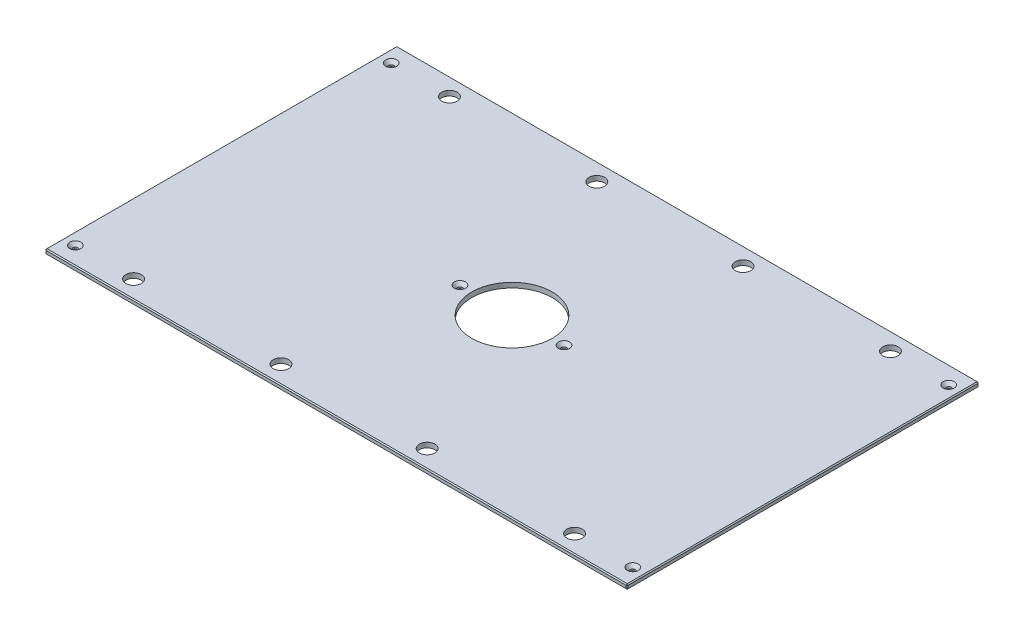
ISO-10303-21;
HEADER;
FILE_DESCRIPTION(('STEP AP214'),'2;1');
FILE_NAME('part.step','',(''),(''),'','','');
FILE_SCHEMA(('AUTOMOTIVE_DESIGN { 1 0 10303 214 1 1 1 1 }'));
ENDSEC;
DATA;
#1=APPLICATION_CONTEXT('core data for automotive mechanical design processes');
#2=APPLICATION_PROTOCOL_DEFINITION('international standard','automotive_design',2000,#1);
#3=PRODUCT_CONTEXT('',#1,'mechanical');
#4=PRODUCT('Part','Part','',(#3));
#5=PRODUCT_RELATED_PRODUCT_CATEGORY('part','',(#4));
#6=PRODUCT_DEFINITION_FORMATION('','',#4);
#7=PRODUCT_DEFINITION_CONTEXT('part definition',#1,'design');
#8=PRODUCT_DEFINITION('design','',#6,#7);
#9=PRODUCT_DEFINITION_SHAPE('','',#8);
#10=(LENGTH_UNIT() NAMED_UNIT(*) SI_UNIT(.MILLI.,.METRE.));
#11=(NAMED_UNIT(*) PLANE_ANGLE_UNIT() SI_UNIT($,.RADIAN.));
#12=(NAMED_UNIT(*) SI_UNIT($,.STERADIAN.) SOLID_ANGLE_UNIT());
#13=UNCERTAINTY_MEASURE_WITH_UNIT(LENGTH_MEASURE(1.E-05),#10,'distance_accuracy_value','');
#14=(GEOMETRIC_REPRESENTATION_CONTEXT(3) GLOBAL_UNCERTAINTY_ASSIGNED_CONTEXT((#13)) GLOBAL_UNIT_ASSIGNED_CONTEXT((#10,
#11,#12)) REPRESENTATION_CONTEXT('',''));
#15=CARTESIAN_POINT('',(0.,0.,0.));
#16=DIRECTION('',(0.,0.,1.));
#17=DIRECTION('',(1.,0.,0.));
#18=AXIS2_PLACEMENT_3D('',#15,#16,#17);
#19=CARTESIAN_POINT('',(-373.0625,6.35,-225.425));
#20=DIRECTION('',(1.,0.,0.));
#21=DIRECTION('',(0.,0.,-1.));
#22=AXIS2_PLACEMENT_3D('',#19,#20,#21);
#23=PLANE('',#22);
#24=DIRECTION('',(0.,0.,-1.));
#25=VECTOR('',#24,1.);
#26=CARTESIAN_POINT('',(-373.0625,5.08000000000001,-225.425));
#27=LINE('',#26,#25);
#28=CARTESIAN_POINT('',(-373.0625,5.08000000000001,224.155));
#29=VERTEX_POINT('',#28);
#30=CARTESIAN_POINT('',(-373.0625,5.08000000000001,-224.155));
#31=VERTEX_POINT('',#30);
#32=EDGE_CURVE('E135',#29,#31,#27,.T.);
#33=ORIENTED_EDGE('',*,*,#32,.T.);
#34=DIRECTION('',(0.,-1.,0.));
#35=VECTOR('',#34,1.);
#36=CARTESIAN_POINT('',(-373.0625,6.35,-224.155));
#37=LINE('',#36,#35);
#38=CARTESIAN_POINT('',(-373.0625,1.26999999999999,-224.155));
#39=VERTEX_POINT('',#38);
#40=EDGE_CURVE('E131',#31,#39,#37,.T.);
#41=ORIENTED_EDGE('',*,*,#40,.T.);
#42=DIRECTION('',(0.,0.,1.));
#43=VECTOR('',#42,1.);
#44=CARTESIAN_POINT('',(-373.0625,1.26999999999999,-225.425));
#45=LINE('',#44,#43);
#46=CARTESIAN_POINT('',(-373.0625,1.26999999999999,224.155));
#47=VERTEX_POINT('',#46);
#48=EDGE_CURVE('E126',#39,#47,#45,.T.);
#49=ORIENTED_EDGE('',*,*,#48,.T.);
#50=DIRECTION('',(0.,1.,0.));
#51=VECTOR('',#50,1.);
#52=CARTESIAN_POINT('',(-373.0625,6.35,224.155));
#53=LINE('',#52,#51);
#54=EDGE_CURVE('E128',#47,#29,#53,.T.);
#55=ORIENTED_EDGE('',*,*,#54,.T.);
#56=EDGE_LOOP('',(#33,#41,#49,#55));
#57=FACE_BOUND('',#56,.T.);
#58=ADVANCED_FACE('F35',(#57),#23,.F.);
#59=CARTESIAN_POINT('',(-373.0625,6.35,225.425));
#60=DIRECTION('',(0.,0.,-1.));
#61=DIRECTION('',(-1.,0.,0.));
#62=AXIS2_PLACEMENT_3D('',#59,#60,#61);
#63=PLANE('',#62);
#64=DIRECTION('',(1.,0.,0.));
#65=VECTOR('',#64,1.);
#66=CARTESIAN_POINT('',(-373.0625,1.26999999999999,225.425));
#67=LINE('',#66,#65);
#68=CARTESIAN_POINT('',(-371.7925,1.26999999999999,225.425));
#69=VERTEX_POINT('',#68);
#70=CARTESIAN_POINT('',(371.7925,1.26999999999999,225.425));
#71=VERTEX_POINT('',#70);
#72=EDGE_CURVE('E58',#69,#71,#67,.T.);
#73=ORIENTED_EDGE('',*,*,#72,.T.);
#74=DIRECTION('',(0.,1.,0.));
#75=VECTOR('',#74,1.);
#76=CARTESIAN_POINT('',(371.7925,6.35,225.425));
#77=LINE('',#76,#75);
#78=CARTESIAN_POINT('',(371.7925,5.08000000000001,225.425));
#79=VERTEX_POINT('',#78);
#80=EDGE_CURVE('E11',#71,#79,#77,.T.);
#81=ORIENTED_EDGE('',*,*,#80,.T.);
#82=DIRECTION('',(-1.,0.,0.));
#83=VECTOR('',#82,1.);
#84=CARTESIAN_POINT('',(-373.0625,5.08000000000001,225.425));
#85=LINE('',#84,#83);
#86=CARTESIAN_POINT('',(-371.7925,5.08000000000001,225.425));
#87=VERTEX_POINT('',#86);
#88=EDGE_CURVE('E44',#79,#87,#85,.T.);
#89=ORIENTED_EDGE('',*,*,#88,.T.);
#90=DIRECTION('',(0.,-1.,0.));
#91=VECTOR('',#90,1.);
#92=CARTESIAN_POINT('',(-371.7925,6.35,225.425));
#93=LINE('',#92,#91);
#94=EDGE_CURVE('E303',#87,#69,#93,.T.);
#95=ORIENTED_EDGE('',*,*,#94,.T.);
#96=EDGE_LOOP('',(#73,#81,#89,#95));
#97=FACE_BOUND('',#96,.T.);
#98=ADVANCED_FACE('F372',(#97),#63,.F.);
#99=CARTESIAN_POINT('',(373.0625,6.35,-225.425));
#100=DIRECTION('',(-1.,0.,0.));
#101=DIRECTION('',(0.,0.,1.));
#102=AXIS2_PLACEMENT_3D('',#99,#100,#101);
#103=PLANE('',#102);
#104=DIRECTION('',(0.,0.,-1.));
#105=VECTOR('',#104,1.);
#106=CARTESIAN_POINT('',(373.0625,1.26999999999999,-225.425));
#107=LINE('',#106,#105);
#108=CARTESIAN_POINT('',(373.0625,1.26999999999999,224.155));
#109=VERTEX_POINT('',#108);
#110=CARTESIAN_POINT('',(373.0625,1.26999999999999,-224.155));
#111=VERTEX_POINT('',#110);
#112=EDGE_CURVE('E298',#109,#111,#107,.T.);
#113=ORIENTED_EDGE('',*,*,#112,.T.);
#114=DIRECTION('',(0.,1.,0.));
#115=VECTOR('',#114,1.);
#116=CARTESIAN_POINT('',(373.0625,6.35,-224.155));
#117=LINE('',#116,#115);
#118=CARTESIAN_POINT('',(373.0625,5.08000000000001,-224.155));
#119=VERTEX_POINT('',#118);
#120=EDGE_CURVE('E300',#111,#119,#117,.T.);
#121=ORIENTED_EDGE('',*,*,#120,.T.);
#122=DIRECTION('',(0.,0.,1.));
#123=VECTOR('',#122,1.);
#124=CARTESIAN_POINT('',(373.0625,5.08000000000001,225.425));
#125=LINE('',#124,#123);
#126=CARTESIAN_POINT('',(373.0625,5.08000000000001,224.155));
#127=VERTEX_POINT('',#126);
#128=EDGE_CURVE('E296',#119,#127,#125,.T.);
#129=ORIENTED_EDGE('',*,*,#128,.T.);
#130=DIRECTION('',(0.,-1.,0.));
#131=VECTOR('',#130,1.);
#132=CARTESIAN_POINT('',(373.0625,6.35,224.155));
#133=LINE('',#132,#131);
#134=EDGE_CURVE('E294',#127,#109,#133,.T.);
#135=ORIENTED_EDGE('',*,*,#134,.T.);
#136=EDGE_LOOP('',(#113,#121,#129,#135));
#137=FACE_BOUND('',#136,.T.);
#138=ADVANCED_FACE('F359',(#137),#103,.F.);
#139=CARTESIAN_POINT('',(-373.0625,6.35,-225.425));
#140=DIRECTION('',(0.,0.,1.));
#141=DIRECTION('',(1.,0.,0.));
#142=AXIS2_PLACEMENT_3D('',#139,#140,#141);
#143=PLANE('',#142);
#144=DIRECTION('',(-1.,0.,0.));
#145=VECTOR('',#144,1.);
#146=CARTESIAN_POINT('',(-373.0625,1.26999999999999,-225.425));
#147=LINE('',#146,#145);
#148=CARTESIAN_POINT('',(371.7925,1.26999999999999,-225.425));
#149=VERTEX_POINT('',#148);
#150=CARTESIAN_POINT('',(-371.7925,1.26999999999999,-225.425));
#151=VERTEX_POINT('',#150);
#152=EDGE_CURVE('E270',#149,#151,#147,.T.);
#153=ORIENTED_EDGE('',*,*,#152,.T.);
#154=DIRECTION('',(0.,1.,0.));
#155=VECTOR('',#154,1.);
#156=CARTESIAN_POINT('',(-371.7925,6.35,-225.425));
#157=LINE('',#156,#155);
#158=CARTESIAN_POINT('',(-371.7925,5.08000000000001,-225.425));
#159=VERTEX_POINT('',#158);
#160=EDGE_CURVE('E274',#151,#159,#157,.T.);
#161=ORIENTED_EDGE('',*,*,#160,.T.);
#162=DIRECTION('',(1.,0.,0.));
#163=VECTOR('',#162,1.);
#164=CARTESIAN_POINT('',(373.0625,5.08000000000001,-225.425));
#165=LINE('',#164,#163);
#166=CARTESIAN_POINT('',(371.7925,5.08000000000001,-225.425));
#167=VERTEX_POINT('',#166);
#168=EDGE_CURVE('E272',#159,#167,#165,.T.);
#169=ORIENTED_EDGE('',*,*,#168,.T.);
#170=DIRECTION('',(0.,-1.,0.));
#171=VECTOR('',#170,1.);
#172=CARTESIAN_POINT('',(371.7925,6.35,-225.425));
#173=LINE('',#172,#171);
#174=EDGE_CURVE('E268',#167,#149,#173,.T.);
#175=ORIENTED_EDGE('',*,*,#174,.T.);
#176=EDGE_LOOP('',(#153,#161,#169,#175));
#177=FACE_BOUND('',#176,.T.);
#178=ADVANCED_FACE('F333',(#177),#143,.F.);
#179=CARTESIAN_POINT('',(0.,6.35,0.));
#180=DIRECTION('',(0.,1.,0.));
#181=DIRECTION('',(0.,0.,1.));
#182=AXIS2_PLACEMENT_3D('',#179,#180,#181);
#183=PLANE('',#182);
#184=CARTESIAN_POINT('',(357.1875,6.35,-202.40498));
#185=DIRECTION('',(0.,1.,0.));
#186=DIRECTION('',(0.,0.,1.));
#187=AXIS2_PLACEMENT_3D('',#184,#185,#186);
#188=CIRCLE('',#187,7.13740000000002);
#189=CARTESIAN_POINT('',(357.1875,6.35,-195.26758));
#190=VERTEX_POINT('',#189);
#191=EDGE_CURVE('E816',#190,#190,#188,.T.);
#192=ORIENTED_EDGE('',*,*,#191,.F.);
#193=EDGE_LOOP('',(#192));
#194=FACE_BOUND('',#193,.T.);
#195=CARTESIAN_POINT('',(357.1875,6.35,202.40498));
#196=DIRECTION('',(0.,1.,0.));
#197=DIRECTION('',(0.,0.,1.));
#198=AXIS2_PLACEMENT_3D('',#195,#196,#197);
#199=CIRCLE('',#198,7.13740000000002);
#200=CARTESIAN_POINT('',(357.1875,6.35,209.54238));
#201=VERTEX_POINT('',#200);
#202=EDGE_CURVE('E820',#201,#201,#199,.T.);
#203=ORIENTED_EDGE('',*,*,#202,.F.);
#204=EDGE_LOOP('',(#203));
#205=FACE_BOUND('',#204,.T.);
#206=CARTESIAN_POINT('',(-357.1875,6.35,202.40498));
#207=DIRECTION('',(0.,1.,0.));
#208=DIRECTION('',(0.,0.,1.));
#209=AXIS2_PLACEMENT_3D('',#206,#207,#208);
#210=CIRCLE('',#209,7.13740000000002);
#211=CARTESIAN_POINT('',(-357.1875,6.35,209.54238));
#212=VERTEX_POINT('',#211);
#213=EDGE_CURVE('E824',#212,#212,#210,.T.);
#214=ORIENTED_EDGE('',*,*,#213,.F.);
#215=EDGE_LOOP('',(#214));
#216=FACE_BOUND('',#215,.T.);
#217=CARTESIAN_POINT('',(-66.675,6.35,0.));
#218=DIRECTION('',(0.,1.,0.));
#219=DIRECTION('',(0.,0.,1.));
#220=AXIS2_PLACEMENT_3D('',#217,#218,#219);
#221=CIRCLE('',#220,7.1374);
#222=CARTESIAN_POINT('',(-66.675,6.35,7.1374));
#223=VERTEX_POINT('',#222);
#224=EDGE_CURVE('E828',#223,#223,#221,.T.);
#225=ORIENTED_EDGE('',*,*,#224,.F.);
#226=EDGE_LOOP('',(#225));
#227=FACE_BOUND('',#226,.T.);
#228=CARTESIAN_POINT('',(66.675,6.35,0.));
#229=DIRECTION('',(0.,1.,0.));
#230=DIRECTION('',(0.,0.,1.));
#231=AXIS2_PLACEMENT_3D('',#228,#229,#230);
#232=CIRCLE('',#231,7.1374);
#233=CARTESIAN_POINT('',(66.675,6.35,7.1374));
#234=VERTEX_POINT('',#233);
#235=EDGE_CURVE('E832',#234,#234,#232,.T.);
#236=ORIENTED_EDGE('',*,*,#235,.F.);
#237=EDGE_LOOP('',(#236));
#238=FACE_BOUND('',#237,.T.);
#239=CARTESIAN_POINT('',(-357.1875,6.35,-202.40498));
#240=DIRECTION('',(0.,1.,0.));
#241=DIRECTION('',(0.,0.,1.));
#242=AXIS2_PLACEMENT_3D('',#239,#240,#241);
#243=CIRCLE('',#242,7.13740000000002);
#244=CARTESIAN_POINT('',(-357.1875,6.35,-195.26758));
#245=VERTEX_POINT('',#244);
#246=EDGE_CURVE('E835',#245,#245,#243,.T.);
#247=ORIENTED_EDGE('',*,*,#246,.F.);
#248=EDGE_LOOP('',(#247));
#249=FACE_BOUND('',#248,.T.);
#250=DIRECTION('',(0.,0.,-1.));
#251=VECTOR('',#250,1.);
#252=CARTESIAN_POINT('',(371.7925,6.35,-225.425));
#253=LINE('',#252,#251);
#254=CARTESIAN_POINT('',(371.7925,6.35,224.155));
#255=VERTEX_POINT('',#254);
#256=CARTESIAN_POINT('',(371.7925,6.35,-224.155));
#257=VERTEX_POINT('',#256);
#258=EDGE_CURVE('E281',#255,#257,#253,.T.);
#259=ORIENTED_EDGE('',*,*,#258,.T.);
#260=DIRECTION('',(-1.,0.,0.));
#261=VECTOR('',#260,1.);
#262=CARTESIAN_POINT('',(-373.0625,6.35,-224.155));
#263=LINE('',#262,#261);
#264=CARTESIAN_POINT('',(-371.7925,6.35,-224.155));
#265=VERTEX_POINT('',#264);
#266=EDGE_CURVE('E283',#257,#265,#263,.T.);
#267=ORIENTED_EDGE('',*,*,#266,.T.);
#268=DIRECTION('',(0.,0.,1.));
#269=VECTOR('',#268,1.);
#270=CARTESIAN_POINT('',(-371.7925,6.35,225.425));
#271=LINE('',#270,#269);
#272=CARTESIAN_POINT('',(-371.7925,6.35,224.155));
#273=VERTEX_POINT('',#272);
#274=EDGE_CURVE('E279',#265,#273,#271,.T.);
#275=ORIENTED_EDGE('',*,*,#274,.T.);
#276=DIRECTION('',(1.,0.,0.));
#277=VECTOR('',#276,1.);
#278=CARTESIAN_POINT('',(373.0625,6.35,224.155));
#279=LINE('',#278,#277);
#280=EDGE_CURVE('E277',#273,#255,#279,.T.);
#281=ORIENTED_EDGE('',*,*,#280,.T.);
#282=EDGE_LOOP('',(#259,#267,#275,#281));
#283=FACE_BOUND('',#282,.T.);
#284=CARTESIAN_POINT('',(282.575,6.35,-202.40498));
#285=DIRECTION('',(0.,1.,0.));
#286=DIRECTION('',(0.,0.,1.));
#287=AXIS2_PLACEMENT_3D('',#284,#285,#286);
#288=CIRCLE('',#287,9.92187500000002);
#289=CARTESIAN_POINT('',(282.575,6.35,-192.483105));
#290=VERTEX_POINT('',#289);
#291=EDGE_CURVE('E204',#290,#290,#288,.T.);
#292=ORIENTED_EDGE('',*,*,#291,.F.);
#293=EDGE_LOOP('',(#292));
#294=FACE_BOUND('',#293,.T.);
#295=CARTESIAN_POINT('',(-282.575,6.35,-202.40498));
#296=DIRECTION('',(0.,1.,0.));
#297=DIRECTION('',(0.,0.,1.));
#298=AXIS2_PLACEMENT_3D('',#295,#296,#297);
#299=CIRCLE('',#298,9.92187500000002);
#300=CARTESIAN_POINT('',(-282.575,6.35,-192.483105));
#301=VERTEX_POINT('',#300);
#302=EDGE_CURVE('E214',#301,#301,#299,.T.);
#303=ORIENTED_EDGE('',*,*,#302,.F.);
#304=EDGE_LOOP('',(#303));
#305=FACE_BOUND('',#304,.T.);
#306=CARTESIAN_POINT('',(282.575,6.35,202.40498));
#307=DIRECTION('',(0.,1.,0.));
#308=DIRECTION('',(0.,0.,1.));
#309=AXIS2_PLACEMENT_3D('',#306,#307,#308);
#310=CIRCLE('',#309,9.92187500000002);
#311=CARTESIAN_POINT('',(282.575,6.35,212.326855));
#312=VERTEX_POINT('',#311);
#313=EDGE_CURVE('E225',#312,#312,#310,.T.);
#314=ORIENTED_EDGE('',*,*,#313,.F.);
#315=EDGE_LOOP('',(#314));
#316=FACE_BOUND('',#315,.T.);
#317=CARTESIAN_POINT('',(-282.575,6.35,202.40498));
#318=DIRECTION('',(0.,1.,0.));
#319=DIRECTION('',(0.,0.,1.));
#320=AXIS2_PLACEMENT_3D('',#317,#318,#319);
#321=CIRCLE('',#320,9.92187500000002);
#322=CARTESIAN_POINT('',(-282.575,6.35,212.326855));
#323=VERTEX_POINT('',#322);
#324=EDGE_CURVE('E231',#323,#323,#321,.T.);
#325=ORIENTED_EDGE('',*,*,#324,.F.);
#326=EDGE_LOOP('',(#325));
#327=FACE_BOUND('',#326,.T.);
#328=CARTESIAN_POINT('',(-93.6625,6.35,-202.40498));
#329=DIRECTION('',(0.,1.,0.));
#330=DIRECTION('',(0.,0.,1.));
#331=AXIS2_PLACEMENT_3D('',#328,#329,#330);
#332=CIRCLE('',#331,9.921875);
#333=CARTESIAN_POINT('',(-93.6625,6.35,-192.483105));
#334=VERTEX_POINT('',#333);
#335=EDGE_CURVE('E237',#334,#334,#332,.T.);
#336=ORIENTED_EDGE('',*,*,#335,.F.);
#337=EDGE_LOOP('',(#336));
#338=FACE_BOUND('',#337,.T.);
#339=CARTESIAN_POINT('',(93.6625,6.35,-202.40498));
#340=DIRECTION('',(0.,1.,0.));
#341=DIRECTION('',(0.,0.,1.));
#342=AXIS2_PLACEMENT_3D('',#339,#340,#341);
#343=CIRCLE('',#342,9.921875);
#344=CARTESIAN_POINT('',(93.6625,6.35,-192.483105));
#345=VERTEX_POINT('',#344);
#346=EDGE_CURVE('E243',#345,#345,#343,.T.);
#347=ORIENTED_EDGE('',*,*,#346,.F.);
#348=EDGE_LOOP('',(#347));
#349=FACE_BOUND('',#348,.T.);
#350=CARTESIAN_POINT('',(93.6625,6.35,202.40498));
#351=DIRECTION('',(0.,1.,0.));
#352=DIRECTION('',(0.,0.,1.));
#353=AXIS2_PLACEMENT_3D('',#350,#351,#352);
#354=CIRCLE('',#353,9.921875);
#355=CARTESIAN_POINT('',(93.6625,6.35,212.326855));
#356=VERTEX_POINT('',#355);
#357=EDGE_CURVE('E249',#356,#356,#354,.T.);
#358=ORIENTED_EDGE('',*,*,#357,.F.);
#359=EDGE_LOOP('',(#358));
#360=FACE_BOUND('',#359,.T.);
#361=CARTESIAN_POINT('',(-93.6625,6.35,202.40498));
#362=DIRECTION('',(0.,1.,0.));
#363=DIRECTION('',(0.,0.,1.));
#364=AXIS2_PLACEMENT_3D('',#361,#362,#363);
#365=CIRCLE('',#364,9.921875);
#366=CARTESIAN_POINT('',(-93.6625,6.35,212.326855));
#367=VERTEX_POINT('',#366);
#368=EDGE_CURVE('E255',#367,#367,#365,.T.);
#369=ORIENTED_EDGE('',*,*,#368,.F.);
#370=EDGE_LOOP('',(#369));
#371=FACE_BOUND('',#370,.T.);
#372=CARTESIAN_POINT('',(0.,6.35,0.));
#373=DIRECTION('',(0.,1.,0.));
#374=DIRECTION('',(0.,0.,1.));
#375=AXIS2_PLACEMENT_3D('',#372,#373,#374);
#376=CIRCLE('',#375,51.562);
#377=CARTESIAN_POINT('',(0.,6.35,51.562));
#378=VERTEX_POINT('',#377);
#379=EDGE_CURVE('E261',#378,#378,#376,.T.);
#380=ORIENTED_EDGE('',*,*,#379,.F.);
#381=EDGE_LOOP('',(#380));
#382=FACE_BOUND('',#381,.T.);
#383=ADVANCED_FACE('F381',(#194,#205,#216,#227,#238,#249,#283,#294,#305,#316,#327,#338,#349,
#360,#371,#382),#183,.T.);
#384=CARTESIAN_POINT('',(0.,0.,0.));
#385=DIRECTION('',(0.,1.,0.));
#386=DIRECTION('',(0.,0.,1.));
#387=AXIS2_PLACEMENT_3D('',#384,#385,#386);
#388=PLANE('',#387);
#389=CARTESIAN_POINT('',(357.1875,0.,-202.40498));
#390=DIRECTION('',(0.,1.,0.));
#391=DIRECTION('',(0.,0.,1.));
#392=AXIS2_PLACEMENT_3D('',#389,#390,#391);
#393=CIRCLE('',#392,3.3782);
#394=CARTESIAN_POINT('',(357.1875,0.,-199.02678));
#395=VERTEX_POINT('',#394);
#396=EDGE_CURVE('E869',#395,#395,#393,.T.);
#397=ORIENTED_EDGE('',*,*,#396,.T.);
#398=EDGE_LOOP('',(#397));
#399=FACE_BOUND('',#398,.T.);
#400=CARTESIAN_POINT('',(357.1875,0.,202.40498));
#401=DIRECTION('',(0.,1.,0.));
#402=DIRECTION('',(0.,0.,1.));
#403=AXIS2_PLACEMENT_3D('',#400,#401,#402);
#404=CIRCLE('',#403,3.3782);
#405=CARTESIAN_POINT('',(357.1875,0.,205.78318));
#406=VERTEX_POINT('',#405);
#407=EDGE_CURVE('E862',#406,#406,#404,.T.);
#408=ORIENTED_EDGE('',*,*,#407,.T.);
#409=EDGE_LOOP('',(#408));
#410=FACE_BOUND('',#409,.T.);
#411=CARTESIAN_POINT('',(-357.1875,0.,202.40498));
#412=DIRECTION('',(0.,1.,0.));
#413=DIRECTION('',(0.,0.,1.));
#414=AXIS2_PLACEMENT_3D('',#411,#412,#413);
#415=CIRCLE('',#414,3.3782);
#416=CARTESIAN_POINT('',(-357.1875,0.,205.78318));
#417=VERTEX_POINT('',#416);
#418=EDGE_CURVE('E855',#417,#417,#415,.T.);
#419=ORIENTED_EDGE('',*,*,#418,.T.);
#420=EDGE_LOOP('',(#419));
#421=FACE_BOUND('',#420,.T.);
#422=CARTESIAN_POINT('',(-66.675,0.,0.));
#423=DIRECTION('',(0.,1.,0.));
#424=DIRECTION('',(0.,0.,1.));
#425=AXIS2_PLACEMENT_3D('',#422,#423,#424);
#426=CIRCLE('',#425,3.3782);
#427=CARTESIAN_POINT('',(-66.675,0.,3.3782));
#428=VERTEX_POINT('',#427);
#429=EDGE_CURVE('E848',#428,#428,#426,.T.);
#430=ORIENTED_EDGE('',*,*,#429,.T.);
#431=EDGE_LOOP('',(#430));
#432=FACE_BOUND('',#431,.T.);
#433=CARTESIAN_POINT('',(66.675,0.,0.));
#434=DIRECTION('',(0.,1.,0.));
#435=DIRECTION('',(0.,0.,1.));
#436=AXIS2_PLACEMENT_3D('',#433,#434,#435);
#437=CIRCLE('',#436,3.3782);
#438=CARTESIAN_POINT('',(66.675,0.,3.3782));
#439=VERTEX_POINT('',#438);
#440=EDGE_CURVE('E838',#439,#439,#437,.T.);
#441=ORIENTED_EDGE('',*,*,#440,.T.);
#442=EDGE_LOOP('',(#441));
#443=FACE_BOUND('',#442,.T.);
#444=CARTESIAN_POINT('',(-357.1875,0.,-202.40498));
#445=DIRECTION('',(0.,1.,0.));
#446=DIRECTION('',(0.,0.,1.));
#447=AXIS2_PLACEMENT_3D('',#444,#445,#446);
#448=CIRCLE('',#447,3.3782);
#449=CARTESIAN_POINT('',(-357.1875,0.,-199.02678));
#450=VERTEX_POINT('',#449);
#451=EDGE_CURVE('E217',#450,#450,#448,.T.);
#452=ORIENTED_EDGE('',*,*,#451,.T.);
#453=EDGE_LOOP('',(#452));
#454=FACE_BOUND('',#453,.T.);
#455=DIRECTION('',(0.,0.,-1.));
#456=VECTOR('',#455,1.);
#457=CARTESIAN_POINT('',(-371.7925,0.,0.));
#458=LINE('',#457,#456);
#459=CARTESIAN_POINT('',(-371.7925,0.,224.155));
#460=VERTEX_POINT('',#459);
#461=CARTESIAN_POINT('',(-371.7925,0.,-224.155));
#462=VERTEX_POINT('',#461);
#463=EDGE_CURVE('E158',#460,#462,#458,.T.);
#464=ORIENTED_EDGE('',*,*,#463,.T.);
#465=DIRECTION('',(1.,0.,0.));
#466=VECTOR('',#465,1.);
#467=CARTESIAN_POINT('',(0.,0.,-224.155));
#468=LINE('',#467,#466);
#469=CARTESIAN_POINT('',(371.7925,0.,-224.155));
#470=VERTEX_POINT('',#469);
#471=EDGE_CURVE('E291',#462,#470,#468,.T.);
#472=ORIENTED_EDGE('',*,*,#471,.T.);
#473=DIRECTION('',(0.,0.,1.));
#474=VECTOR('',#473,1.);
#475=CARTESIAN_POINT('',(371.7925,0.,0.));
#476=LINE('',#475,#474);
#477=CARTESIAN_POINT('',(371.7925,0.,224.155));
#478=VERTEX_POINT('',#477);
#479=EDGE_CURVE('E289',#470,#478,#476,.T.);
#480=ORIENTED_EDGE('',*,*,#479,.T.);
#481=DIRECTION('',(-1.,0.,0.));
#482=VECTOR('',#481,1.);
#483=CARTESIAN_POINT('',(0.,0.,224.155));
#484=LINE('',#483,#482);
#485=EDGE_CURVE('E286',#478,#460,#484,.T.);
#486=ORIENTED_EDGE('',*,*,#485,.T.);
#487=EDGE_LOOP('',(#464,#472,#480,#486));
#488=FACE_BOUND('',#487,.T.);
#489=CARTESIAN_POINT('',(282.575,0.,-202.40498));
#490=DIRECTION('',(0.,1.,0.));
#491=DIRECTION('',(0.,0.,1.));
#492=AXIS2_PLACEMENT_3D('',#489,#490,#491);
#493=CIRCLE('',#492,9.92187500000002);
#494=CARTESIAN_POINT('',(282.575,0.,-192.483105));
#495=VERTEX_POINT('',#494);
#496=EDGE_CURVE('E209',#495,#495,#493,.T.);
#497=ORIENTED_EDGE('',*,*,#496,.T.);
#498=EDGE_LOOP('',(#497));
#499=FACE_BOUND('',#498,.T.);
#500=CARTESIAN_POINT('',(-282.575,0.,-202.40498));
#501=DIRECTION('',(0.,1.,0.));
#502=DIRECTION('',(0.,0.,1.));
#503=AXIS2_PLACEMENT_3D('',#500,#501,#502);
#504=CIRCLE('',#503,9.92187500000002);
#505=CARTESIAN_POINT('',(-282.575,0.,-192.483105));
#506=VERTEX_POINT('',#505);
#507=EDGE_CURVE('E222',#506,#506,#504,.T.);
#508=ORIENTED_EDGE('',*,*,#507,.T.);
#509=EDGE_LOOP('',(#508));
#510=FACE_BOUND('',#509,.T.);
#511=CARTESIAN_POINT('',(282.575,0.,202.40498));
#512=DIRECTION('',(0.,1.,0.));
#513=DIRECTION('',(0.,0.,1.));
#514=AXIS2_PLACEMENT_3D('',#511,#512,#513);
#515=CIRCLE('',#514,9.92187500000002);
#516=CARTESIAN_POINT('',(282.575,0.,212.326855));
#517=VERTEX_POINT('',#516);
#518=EDGE_CURVE('E228',#517,#517,#515,.T.);
#519=ORIENTED_EDGE('',*,*,#518,.T.);
#520=EDGE_LOOP('',(#519));
#521=FACE_BOUND('',#520,.T.);
#522=CARTESIAN_POINT('',(-282.575,0.,202.40498));
#523=DIRECTION('',(0.,1.,0.));
#524=DIRECTION('',(0.,0.,1.));
#525=AXIS2_PLACEMENT_3D('',#522,#523,#524);
#526=CIRCLE('',#525,9.92187500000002);
#527=CARTESIAN_POINT('',(-282.575,0.,212.326855));
#528=VERTEX_POINT('',#527);
#529=EDGE_CURVE('E234',#528,#528,#526,.T.);
#530=ORIENTED_EDGE('',*,*,#529,.T.);
#531=EDGE_LOOP('',(#530));
#532=FACE_BOUND('',#531,.T.);
#533=CARTESIAN_POINT('',(-93.6625,0.,-202.40498));
#534=DIRECTION('',(0.,1.,0.));
#535=DIRECTION('',(0.,0.,1.));
#536=AXIS2_PLACEMENT_3D('',#533,#534,#535);
#537=CIRCLE('',#536,9.921875);
#538=CARTESIAN_POINT('',(-93.6625,0.,-192.483105));
#539=VERTEX_POINT('',#538);
#540=EDGE_CURVE('E240',#539,#539,#537,.T.);
#541=ORIENTED_EDGE('',*,*,#540,.T.);
#542=EDGE_LOOP('',(#541));
#543=FACE_BOUND('',#542,.T.);
#544=CARTESIAN_POINT('',(93.6625,0.,-202.40498));
#545=DIRECTION('',(0.,1.,0.));
#546=DIRECTION('',(0.,0.,1.));
#547=AXIS2_PLACEMENT_3D('',#544,#545,#546);
#548=CIRCLE('',#547,9.921875);
#549=CARTESIAN_POINT('',(93.6625,0.,-192.483105));
#550=VERTEX_POINT('',#549);
#551=EDGE_CURVE('E246',#550,#550,#548,.T.);
#552=ORIENTED_EDGE('',*,*,#551,.T.);
#553=EDGE_LOOP('',(#552));
#554=FACE_BOUND('',#553,.T.);
#555=CARTESIAN_POINT('',(93.6625,0.,202.40498));
#556=DIRECTION('',(0.,1.,0.));
#557=DIRECTION('',(0.,0.,1.));
#558=AXIS2_PLACEMENT_3D('',#555,#556,#557);
#559=CIRCLE('',#558,9.921875);
#560=CARTESIAN_POINT('',(93.6625,0.,212.326855));
#561=VERTEX_POINT('',#560);
#562=EDGE_CURVE('E252',#561,#561,#559,.T.);
#563=ORIENTED_EDGE('',*,*,#562,.T.);
#564=EDGE_LOOP('',(#563));
#565=FACE_BOUND('',#564,.T.);
#566=CARTESIAN_POINT('',(-93.6625,0.,202.40498));
#567=DIRECTION('',(0.,1.,0.));
#568=DIRECTION('',(0.,0.,1.));
#569=AXIS2_PLACEMENT_3D('',#566,#567,#568);
#570=CIRCLE('',#569,9.921875);
#571=CARTESIAN_POINT('',(-93.6625,0.,212.326855));
#572=VERTEX_POINT('',#571);
#573=EDGE_CURVE('E258',#572,#572,#570,.T.);
#574=ORIENTED_EDGE('',*,*,#573,.T.);
#575=EDGE_LOOP('',(#574));
#576=FACE_BOUND('',#575,.T.);
#577=CARTESIAN_POINT('',(0.,0.,0.));
#578=DIRECTION('',(0.,1.,0.));
#579=DIRECTION('',(0.,0.,1.));
#580=AXIS2_PLACEMENT_3D('',#577,#578,#579);
#581=CIRCLE('',#580,51.562);
#582=CARTESIAN_POINT('',(0.,0.,51.562));
#583=VERTEX_POINT('',#582);
#584=EDGE_CURVE('E147',#583,#583,#581,.T.);
#585=ORIENTED_EDGE('',*,*,#584,.T.);
#586=EDGE_LOOP('',(#585));
#587=FACE_BOUND('',#586,.T.);
#588=ADVANCED_FACE('F346',(#399,#410,#421,#432,#443,#454,#488,#499,#510,#521,#532,#543,#554,
#565,#576,#587),#388,.F.);
#589=CARTESIAN_POINT('',(0.,0.,0.));
#590=DIRECTION('',(0.,1.,0.));
#591=DIRECTION('',(0.,0.,1.));
#592=AXIS2_PLACEMENT_3D('',#589,#590,#591);
#593=CYLINDRICAL_SURFACE('',#592,51.562);
#594=ORIENTED_EDGE('',*,*,#584,.F.);
#595=EDGE_LOOP('',(#594));
#596=FACE_BOUND('',#595,.T.);
#597=ORIENTED_EDGE('',*,*,#379,.T.);
#598=EDGE_LOOP('',(#597));
#599=FACE_BOUND('',#598,.T.);
#600=ADVANCED_FACE('F751',(#596,#599),#593,.F.);
#601=CARTESIAN_POINT('',(-93.6625,6.35,202.40498));
#602=DIRECTION('',(0.,1.,0.));
#603=DIRECTION('',(0.,0.,1.));
#604=AXIS2_PLACEMENT_3D('',#601,#602,#603);
#605=CYLINDRICAL_SURFACE('',#604,9.921875);
#606=ORIENTED_EDGE('',*,*,#573,.F.);
#607=EDGE_LOOP('',(#606));
#608=FACE_BOUND('',#607,.T.);
#609=ORIENTED_EDGE('',*,*,#368,.T.);
#610=EDGE_LOOP('',(#609));
#611=FACE_BOUND('',#610,.T.);
#612=ADVANCED_FACE('F742',(#608,#611),#605,.F.);
#613=CARTESIAN_POINT('',(93.6625,6.35,202.40498));
#614=DIRECTION('',(0.,1.,0.));
#615=DIRECTION('',(0.,0.,1.));
#616=AXIS2_PLACEMENT_3D('',#613,#614,#615);
#617=CYLINDRICAL_SURFACE('',#616,9.921875);
#618=ORIENTED_EDGE('',*,*,#562,.F.);
#619=EDGE_LOOP('',(#618));
#620=FACE_BOUND('',#619,.T.);
#621=ORIENTED_EDGE('',*,*,#357,.T.);
#622=EDGE_LOOP('',(#621));
#623=FACE_BOUND('',#622,.T.);
#624=ADVANCED_FACE('F733',(#620,#623),#617,.F.);
#625=CARTESIAN_POINT('',(93.6625,6.35,-202.40498));
#626=DIRECTION('',(0.,1.,0.));
#627=DIRECTION('',(0.,0.,1.));
#628=AXIS2_PLACEMENT_3D('',#625,#626,#627);
#629=CYLINDRICAL_SURFACE('',#628,9.921875);
#630=ORIENTED_EDGE('',*,*,#551,.F.);
#631=EDGE_LOOP('',(#630));
#632=FACE_BOUND('',#631,.T.);
#633=ORIENTED_EDGE('',*,*,#346,.T.);
#634=EDGE_LOOP('',(#633));
#635=FACE_BOUND('',#634,.T.);
#636=ADVANCED_FACE('F724',(#632,#635),#629,.F.);
#637=CARTESIAN_POINT('',(-93.6625,6.35,-202.40498));
#638=DIRECTION('',(0.,1.,0.));
#639=DIRECTION('',(0.,0.,1.));
#640=AXIS2_PLACEMENT_3D('',#637,#638,#639);
#641=CYLINDRICAL_SURFACE('',#640,9.921875);
#642=ORIENTED_EDGE('',*,*,#540,.F.);
#643=EDGE_LOOP('',(#642));
#644=FACE_BOUND('',#643,.T.);
#645=ORIENTED_EDGE('',*,*,#335,.T.);
#646=EDGE_LOOP('',(#645));
#647=FACE_BOUND('',#646,.T.);
#648=ADVANCED_FACE('F715',(#644,#647),#641,.F.);
#649=CARTESIAN_POINT('',(-282.575,6.35,202.40498));
#650=DIRECTION('',(0.,1.,0.));
#651=DIRECTION('',(0.,0.,1.));
#652=AXIS2_PLACEMENT_3D('',#649,#650,#651);
#653=CYLINDRICAL_SURFACE('',#652,9.92187500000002);
#654=ORIENTED_EDGE('',*,*,#529,.F.);
#655=EDGE_LOOP('',(#654));
#656=FACE_BOUND('',#655,.T.);
#657=ORIENTED_EDGE('',*,*,#324,.T.);
#658=EDGE_LOOP('',(#657));
#659=FACE_BOUND('',#658,.T.);
#660=ADVANCED_FACE('F706',(#656,#659),#653,.F.);
#661=CARTESIAN_POINT('',(282.575,6.35,202.40498));
#662=DIRECTION('',(0.,1.,0.));
#663=DIRECTION('',(0.,0.,1.));
#664=AXIS2_PLACEMENT_3D('',#661,#662,#663);
#665=CYLINDRICAL_SURFACE('',#664,9.92187500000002);
#666=ORIENTED_EDGE('',*,*,#518,.F.);
#667=EDGE_LOOP('',(#666));
#668=FACE_BOUND('',#667,.T.);
#669=ORIENTED_EDGE('',*,*,#313,.T.);
#670=EDGE_LOOP('',(#669));
#671=FACE_BOUND('',#670,.T.);
#672=ADVANCED_FACE('F697',(#668,#671),#665,.F.);
#673=CARTESIAN_POINT('',(-282.575,6.35,-202.40498));
#674=DIRECTION('',(0.,1.,0.));
#675=DIRECTION('',(0.,0.,1.));
#676=AXIS2_PLACEMENT_3D('',#673,#674,#675);
#677=CYLINDRICAL_SURFACE('',#676,9.92187500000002);
#678=ORIENTED_EDGE('',*,*,#507,.F.);
#679=EDGE_LOOP('',(#678));
#680=FACE_BOUND('',#679,.T.);
#681=ORIENTED_EDGE('',*,*,#302,.T.);
#682=EDGE_LOOP('',(#681));
#683=FACE_BOUND('',#682,.T.);
#684=ADVANCED_FACE('F687',(#680,#683),#677,.F.);
#685=CARTESIAN_POINT('',(282.575,6.35,-202.40498));
#686=DIRECTION('',(0.,1.,0.));
#687=DIRECTION('',(0.,0.,1.));
#688=AXIS2_PLACEMENT_3D('',#685,#686,#687);
#689=CYLINDRICAL_SURFACE('',#688,9.92187500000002);
#690=ORIENTED_EDGE('',*,*,#496,.F.);
#691=EDGE_LOOP('',(#690));
#692=FACE_BOUND('',#691,.T.);
#693=ORIENTED_EDGE('',*,*,#291,.T.);
#694=EDGE_LOOP('',(#693));
#695=FACE_BOUND('',#694,.T.);
#696=ADVANCED_FACE('F390',(#692,#695),#689,.F.);
#697=CARTESIAN_POINT('',(373.0625,6.35,224.155));
#698=DIRECTION('',(-0.707106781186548,0.,-0.707106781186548));
#699=DIRECTION('',(0.,-1.,0.));
#700=AXIS2_PLACEMENT_3D('',#697,#698,#699);
#701=PLANE('',#700);
#702=DIRECTION('',(-0.707106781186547,0.,0.707106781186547));
#703=VECTOR('',#702,1.);
#704=CARTESIAN_POINT('',(373.0625,5.08000000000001,224.155));
#705=LINE('',#704,#703);
#706=EDGE_CURVE('E39',#79,#127,#705,.F.);
#707=ORIENTED_EDGE('',*,*,#706,.F.);
#708=ORIENTED_EDGE('',*,*,#80,.F.);
#709=DIRECTION('',(0.707106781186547,0.,-0.707106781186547));
#710=VECTOR('',#709,1.);
#711=CARTESIAN_POINT('',(372.4275,1.26999999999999,224.79));
#712=LINE('',#711,#710);
#713=EDGE_CURVE('E197',#109,#71,#712,.F.);
#714=ORIENTED_EDGE('',*,*,#713,.F.);
#715=ORIENTED_EDGE('',*,*,#134,.F.);
#716=EDGE_LOOP('',(#707,#708,#714,#715));
#717=FACE_BOUND('',#716,.T.);
#718=ADVANCED_FACE('F37',(#717),#701,.F.);
#719=CARTESIAN_POINT('',(373.0625,5.08000000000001,224.155));
#720=DIRECTION('',(0.577350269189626,0.577350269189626,0.577350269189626));
#721=DIRECTION('',(0.707106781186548,0.,-0.707106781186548));
#722=AXIS2_PLACEMENT_3D('',#719,#720,#721);
#723=PLANE('',#722);
#724=DIRECTION('',(0.,-0.707106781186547,0.707106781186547));
#725=VECTOR('',#724,1.);
#726=CARTESIAN_POINT('',(371.7925,5.715,224.79));
#727=LINE('',#726,#725);
#728=EDGE_CURVE('E193',#79,#255,#727,.F.);
#729=ORIENTED_EDGE('',*,*,#728,.F.);
#730=ORIENTED_EDGE('',*,*,#706,.T.);
#731=DIRECTION('',(-0.707106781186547,0.707106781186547,0.));
#732=VECTOR('',#731,1.);
#733=CARTESIAN_POINT('',(373.0625,5.08000000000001,224.155));
#734=LINE('',#733,#732);
#735=EDGE_CURVE('E195',#255,#127,#734,.F.);
#736=ORIENTED_EDGE('',*,*,#735,.F.);
#737=EDGE_LOOP('',(#729,#730,#736));
#738=FACE_BOUND('',#737,.T.);
#739=ADVANCED_FACE('F383',(#738),#723,.T.);
#740=CARTESIAN_POINT('',(371.7925,0.,224.155));
#741=DIRECTION('',(0.577350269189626,-0.577350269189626,0.577350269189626));
#742=DIRECTION('',(0.707106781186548,0.,-0.707106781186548));
#743=AXIS2_PLACEMENT_3D('',#740,#741,#742);
#744=PLANE('',#743);
#745=DIRECTION('',(-0.707106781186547,-0.707106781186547,0.));
#746=VECTOR('',#745,1.);
#747=CARTESIAN_POINT('',(371.7925,0.,224.155));
#748=LINE('',#747,#746);
#749=EDGE_CURVE('E187',#109,#478,#748,.T.);
#750=ORIENTED_EDGE('',*,*,#749,.F.);
#751=ORIENTED_EDGE('',*,*,#713,.T.);
#752=DIRECTION('',(0.,0.707106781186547,0.707106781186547));
#753=VECTOR('',#752,1.);
#754=CARTESIAN_POINT('',(371.7925,0.,224.155));
#755=LINE('',#754,#753);
#756=EDGE_CURVE('E190',#478,#71,#755,.T.);
#757=ORIENTED_EDGE('',*,*,#756,.F.);
#758=EDGE_LOOP('',(#750,#751,#757));
#759=FACE_BOUND('',#758,.T.);
#760=ADVANCED_FACE('F352',(#759),#744,.T.);
#761=CARTESIAN_POINT('',(371.7925,6.35,0.));
#762=DIRECTION('',(0.707106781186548,0.707106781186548,0.));
#763=DIRECTION('',(0.,0.,1.));
#764=AXIS2_PLACEMENT_3D('',#761,#762,#763);
#765=PLANE('',#764);
#766=ORIENTED_EDGE('',*,*,#735,.T.);
#767=ORIENTED_EDGE('',*,*,#128,.F.);
#768=DIRECTION('',(0.707106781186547,-0.707106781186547,0.));
#769=VECTOR('',#768,1.);
#770=CARTESIAN_POINT('',(372.4275,5.715,-224.155));
#771=LINE('',#770,#769);
#772=EDGE_CURVE('E182',#257,#119,#771,.T.);
#773=ORIENTED_EDGE('',*,*,#772,.F.);
#774=ORIENTED_EDGE('',*,*,#258,.F.);
#775=EDGE_LOOP('',(#766,#767,#773,#774));
#776=FACE_BOUND('',#775,.T.);
#777=ADVANCED_FACE('F369',(#776),#765,.T.);
#778=CARTESIAN_POINT('',(0.,6.35,224.155));
#779=DIRECTION('',(0.,0.707106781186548,0.707106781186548));
#780=DIRECTION('',(-1.,0.,0.));
#781=AXIS2_PLACEMENT_3D('',#778,#779,#780);
#782=PLANE('',#781);
#783=ORIENTED_EDGE('',*,*,#728,.T.);
#784=ORIENTED_EDGE('',*,*,#280,.F.);
#785=DIRECTION('',(0.,0.707106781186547,-0.707106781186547));
#786=VECTOR('',#785,1.);
#787=CARTESIAN_POINT('',(-371.7925,6.35,224.155));
#788=LINE('',#787,#786);
#789=EDGE_CURVE('E179',#87,#273,#788,.T.);
#790=ORIENTED_EDGE('',*,*,#789,.F.);
#791=ORIENTED_EDGE('',*,*,#88,.F.);
#792=EDGE_LOOP('',(#783,#784,#790,#791));
#793=FACE_BOUND('',#792,.T.);
#794=ADVANCED_FACE('F374',(#793),#782,.T.);
#795=CARTESIAN_POINT('',(-371.7925,6.35,225.425));
#796=DIRECTION('',(0.707106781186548,0.,-0.707106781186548));
#797=DIRECTION('',(0.,-1.,0.));
#798=AXIS2_PLACEMENT_3D('',#795,#796,#797);
#799=PLANE('',#798);
#800=DIRECTION('',(0.707106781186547,0.,0.707106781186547));
#801=VECTOR('',#800,1.);
#802=CARTESIAN_POINT('',(-373.0625,1.26999999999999,224.155));
#803=LINE('',#802,#801);
#804=EDGE_CURVE('E142',#69,#47,#803,.F.);
#805=ORIENTED_EDGE('',*,*,#804,.F.);
#806=ORIENTED_EDGE('',*,*,#94,.F.);
#807=DIRECTION('',(-0.707106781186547,0.,-0.707106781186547));
#808=VECTOR('',#807,1.);
#809=CARTESIAN_POINT('',(-372.4275,5.08000000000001,224.79));
#810=LINE('',#809,#808);
#811=EDGE_CURVE('E145',#29,#87,#810,.F.);
#812=ORIENTED_EDGE('',*,*,#811,.F.);
#813=ORIENTED_EDGE('',*,*,#54,.F.);
#814=EDGE_LOOP('',(#805,#806,#812,#813));
#815=FACE_BOUND('',#814,.T.);
#816=ADVANCED_FACE('F140',(#815),#799,.F.);
#817=CARTESIAN_POINT('',(-373.0625,1.26999999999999,225.425));
#818=DIRECTION('',(0.,0.707106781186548,-0.707106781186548));
#819=DIRECTION('',(1.,0.,0.));
#820=AXIS2_PLACEMENT_3D('',#817,#818,#819);
#821=PLANE('',#820);
#822=ORIENTED_EDGE('',*,*,#756,.T.);
#823=ORIENTED_EDGE('',*,*,#72,.F.);
#824=DIRECTION('',(0.,-0.707106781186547,-0.707106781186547));
#825=VECTOR('',#824,1.);
#826=CARTESIAN_POINT('',(-371.7925,0.634999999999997,224.79));
#827=LINE('',#826,#825);
#828=EDGE_CURVE('E155',#460,#69,#827,.F.);
#829=ORIENTED_EDGE('',*,*,#828,.F.);
#830=ORIENTED_EDGE('',*,*,#485,.F.);
#831=EDGE_LOOP('',(#822,#823,#829,#830));
#832=FACE_BOUND('',#831,.T.);
#833=ADVANCED_FACE('F351',(#832),#821,.F.);
#834=CARTESIAN_POINT('',(373.0625,1.26999999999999,-225.425));
#835=DIRECTION('',(-0.707106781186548,0.707106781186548,0.));
#836=DIRECTION('',(0.,0.,-1.));
#837=AXIS2_PLACEMENT_3D('',#834,#835,#836);
#838=PLANE('',#837);
#839=ORIENTED_EDGE('',*,*,#749,.T.);
#840=ORIENTED_EDGE('',*,*,#479,.F.);
#841=DIRECTION('',(0.707106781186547,0.707106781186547,0.));
#842=VECTOR('',#841,1.);
#843=CARTESIAN_POINT('',(371.7925,0.,-224.155));
#844=LINE('',#843,#842);
#845=EDGE_CURVE('E174',#111,#470,#844,.F.);
#846=ORIENTED_EDGE('',*,*,#845,.F.);
#847=ORIENTED_EDGE('',*,*,#112,.F.);
#848=EDGE_LOOP('',(#839,#840,#846,#847));
#849=FACE_BOUND('',#848,.T.);
#850=ADVANCED_FACE('F356',(#849),#838,.F.);
#851=CARTESIAN_POINT('',(371.7925,6.35,-225.425));
#852=DIRECTION('',(-0.707106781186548,0.,0.707106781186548));
#853=DIRECTION('',(0.,-1.,0.));
#854=AXIS2_PLACEMENT_3D('',#851,#852,#853);
#855=PLANE('',#854);
#856=DIRECTION('',(0.707106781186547,0.,0.707106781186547));
#857=VECTOR('',#856,1.);
#858=CARTESIAN_POINT('',(371.7925,5.08000000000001,-225.425));
#859=LINE('',#858,#857);
#860=EDGE_CURVE('E184',#119,#167,#859,.F.);
#861=ORIENTED_EDGE('',*,*,#860,.F.);
#862=ORIENTED_EDGE('',*,*,#120,.F.);
#863=DIRECTION('',(-0.707106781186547,0.,-0.707106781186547));
#864=VECTOR('',#863,1.);
#865=CARTESIAN_POINT('',(372.4275,1.26999999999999,-224.79));
#866=LINE('',#865,#864);
#867=EDGE_CURVE('E171',#149,#111,#866,.F.);
#868=ORIENTED_EDGE('',*,*,#867,.F.);
#869=ORIENTED_EDGE('',*,*,#174,.F.);
#870=EDGE_LOOP('',(#861,#862,#868,#869));
#871=FACE_BOUND('',#870,.T.);
#872=ADVANCED_FACE('F364',(#871),#855,.F.);
#873=CARTESIAN_POINT('',(371.7925,5.08000000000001,-225.425));
#874=DIRECTION('',(0.577350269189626,0.577350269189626,-0.577350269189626));
#875=DIRECTION('',(-0.707106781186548,0.,-0.707106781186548));
#876=AXIS2_PLACEMENT_3D('',#873,#874,#875);
#877=PLANE('',#876);
#878=ORIENTED_EDGE('',*,*,#772,.T.);
#879=ORIENTED_EDGE('',*,*,#860,.T.);
#880=DIRECTION('',(0.,0.707106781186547,0.707106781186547));
#881=VECTOR('',#880,1.);
#882=CARTESIAN_POINT('',(371.7925,5.08000000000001,-225.425));
#883=LINE('',#882,#881);
#884=EDGE_CURVE('E163',#257,#167,#883,.F.);
#885=ORIENTED_EDGE('',*,*,#884,.F.);
#886=EDGE_LOOP('',(#878,#879,#885));
#887=FACE_BOUND('',#886,.T.);
#888=ADVANCED_FACE('F422',(#887),#877,.T.);
#889=CARTESIAN_POINT('',(-371.7925,6.35,224.155));
#890=DIRECTION('',(-0.577350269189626,0.577350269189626,0.577350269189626));
#891=DIRECTION('',(0.707106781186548,0.,0.707106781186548));
#892=AXIS2_PLACEMENT_3D('',#889,#890,#891);
#893=PLANE('',#892);
#894=ORIENTED_EDGE('',*,*,#811,.T.);
#895=ORIENTED_EDGE('',*,*,#789,.T.);
#896=DIRECTION('',(-0.707106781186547,-0.707106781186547,0.));
#897=VECTOR('',#896,1.);
#898=CARTESIAN_POINT('',(-371.7925,6.35,224.155));
#899=LINE('',#898,#897);
#900=EDGE_CURVE('E159',#29,#273,#899,.F.);
#901=ORIENTED_EDGE('',*,*,#900,.F.);
#902=EDGE_LOOP('',(#894,#895,#901));
#903=FACE_BOUND('',#902,.T.);
#904=ADVANCED_FACE('F376',(#903),#893,.T.);
#905=CARTESIAN_POINT('',(-373.0625,1.26999999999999,224.155));
#906=DIRECTION('',(-0.577350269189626,-0.577350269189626,0.577350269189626));
#907=DIRECTION('',(0.707106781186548,0.,0.707106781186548));
#908=AXIS2_PLACEMENT_3D('',#905,#906,#907);
#909=PLANE('',#908);
#910=ORIENTED_EDGE('',*,*,#828,.T.);
#911=ORIENTED_EDGE('',*,*,#804,.T.);
#912=DIRECTION('',(-0.707106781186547,0.707106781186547,0.));
#913=VECTOR('',#912,1.);
#914=CARTESIAN_POINT('',(-373.0625,1.26999999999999,224.155));
#915=LINE('',#914,#913);
#916=EDGE_CURVE('E152',#460,#47,#915,.T.);
#917=ORIENTED_EDGE('',*,*,#916,.F.);
#918=EDGE_LOOP('',(#910,#911,#917));
#919=FACE_BOUND('',#918,.T.);
#920=ADVANCED_FACE('F151',(#919),#909,.T.);
#921=CARTESIAN_POINT('',(371.7925,0.,-224.155));
#922=DIRECTION('',(0.577350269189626,-0.577350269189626,-0.577350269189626));
#923=DIRECTION('',(-0.707106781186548,0.,-0.707106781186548));
#924=AXIS2_PLACEMENT_3D('',#921,#922,#923);
#925=PLANE('',#924);
#926=ORIENTED_EDGE('',*,*,#867,.T.);
#927=ORIENTED_EDGE('',*,*,#845,.T.);
#928=DIRECTION('',(0.,-0.707106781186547,0.707106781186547));
#929=VECTOR('',#928,1.);
#930=CARTESIAN_POINT('',(371.7925,0.,-224.155));
#931=LINE('',#930,#929);
#932=EDGE_CURVE('E160',#149,#470,#931,.T.);
#933=ORIENTED_EDGE('',*,*,#932,.F.);
#934=EDGE_LOOP('',(#926,#927,#933));
#935=FACE_BOUND('',#934,.T.);
#936=ADVANCED_FACE('F414',(#935),#925,.T.);
#937=CARTESIAN_POINT('',(0.,6.35,-224.155));
#938=DIRECTION('',(0.,0.707106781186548,-0.707106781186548));
#939=DIRECTION('',(1.,0.,0.));
#940=AXIS2_PLACEMENT_3D('',#937,#938,#939);
#941=PLANE('',#940);
#942=ORIENTED_EDGE('',*,*,#884,.T.);
#943=ORIENTED_EDGE('',*,*,#168,.F.);
#944=DIRECTION('',(0.,-0.707106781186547,-0.707106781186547));
#945=VECTOR('',#944,1.);
#946=CARTESIAN_POINT('',(-371.7925,5.08000000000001,-225.425));
#947=LINE('',#946,#945);
#948=EDGE_CURVE('E165',#265,#159,#947,.T.);
#949=ORIENTED_EDGE('',*,*,#948,.F.);
#950=ORIENTED_EDGE('',*,*,#266,.F.);
#951=EDGE_LOOP('',(#942,#943,#949,#950));
#952=FACE_BOUND('',#951,.T.);
#953=ADVANCED_FACE('F328',(#952),#941,.T.);
#954=CARTESIAN_POINT('',(-371.7925,6.35,0.));
#955=DIRECTION('',(-0.707106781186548,0.707106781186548,0.));
#956=DIRECTION('',(0.,0.,-1.));
#957=AXIS2_PLACEMENT_3D('',#954,#955,#956);
#958=PLANE('',#957);
#959=ORIENTED_EDGE('',*,*,#900,.T.);
#960=ORIENTED_EDGE('',*,*,#274,.F.);
#961=DIRECTION('',(0.707106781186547,0.707106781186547,0.));
#962=VECTOR('',#961,1.);
#963=CARTESIAN_POINT('',(-372.4275,5.715,-224.155));
#964=LINE('',#963,#962);
#965=EDGE_CURVE('E317',#31,#265,#964,.T.);
#966=ORIENTED_EDGE('',*,*,#965,.F.);
#967=ORIENTED_EDGE('',*,*,#32,.F.);
#968=EDGE_LOOP('',(#959,#960,#966,#967));
#969=FACE_BOUND('',#968,.T.);
#970=ADVANCED_FACE('F379',(#969),#958,.T.);
#971=CARTESIAN_POINT('',(-373.0625,1.26999999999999,-225.425));
#972=DIRECTION('',(0.707106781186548,0.707106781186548,0.));
#973=DIRECTION('',(0.,0.,1.));
#974=AXIS2_PLACEMENT_3D('',#971,#972,#973);
#975=PLANE('',#974);
#976=ORIENTED_EDGE('',*,*,#916,.T.);
#977=ORIENTED_EDGE('',*,*,#48,.F.);
#978=DIRECTION('',(0.707106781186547,-0.707106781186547,0.));
#979=VECTOR('',#978,1.);
#980=CARTESIAN_POINT('',(-373.0625,1.26999999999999,-224.155));
#981=LINE('',#980,#979);
#982=EDGE_CURVE('E314',#462,#39,#981,.F.);
#983=ORIENTED_EDGE('',*,*,#982,.F.);
#984=ORIENTED_EDGE('',*,*,#463,.F.);
#985=EDGE_LOOP('',(#976,#977,#983,#984));
#986=FACE_BOUND('',#985,.T.);
#987=ADVANCED_FACE('F157',(#986),#975,.F.);
#988=CARTESIAN_POINT('',(-373.0625,1.26999999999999,-225.425));
#989=DIRECTION('',(0.,0.707106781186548,0.707106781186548));
#990=DIRECTION('',(-1.,0.,0.));
#991=AXIS2_PLACEMENT_3D('',#988,#989,#990);
#992=PLANE('',#991);
#993=ORIENTED_EDGE('',*,*,#932,.T.);
#994=ORIENTED_EDGE('',*,*,#471,.F.);
#995=DIRECTION('',(0.,0.707106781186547,-0.707106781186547));
#996=VECTOR('',#995,1.);
#997=CARTESIAN_POINT('',(-371.7925,0.634999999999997,-224.79));
#998=LINE('',#997,#996);
#999=EDGE_CURVE('E311',#151,#462,#998,.F.);
#1000=ORIENTED_EDGE('',*,*,#999,.F.);
#1001=ORIENTED_EDGE('',*,*,#152,.F.);
#1002=EDGE_LOOP('',(#993,#994,#1000,#1001));
#1003=FACE_BOUND('',#1002,.T.);
#1004=ADVANCED_FACE('F343',(#1003),#992,.F.);
#1005=CARTESIAN_POINT('',(-371.7925,5.08000000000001,-225.425));
#1006=DIRECTION('',(-0.577350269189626,0.577350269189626,-0.577350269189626));
#1007=DIRECTION('',(-0.707106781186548,0.,0.707106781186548));
#1008=AXIS2_PLACEMENT_3D('',#1005,#1006,#1007);
#1009=PLANE('',#1008);
#1010=ORIENTED_EDGE('',*,*,#965,.T.);
#1011=ORIENTED_EDGE('',*,*,#948,.T.);
#1012=DIRECTION('',(0.707106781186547,0.,-0.707106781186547));
#1013=VECTOR('',#1012,1.);
#1014=CARTESIAN_POINT('',(-371.7925,5.08000000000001,-225.425));
#1015=LINE('',#1014,#1013);
#1016=EDGE_CURVE('E309',#31,#159,#1015,.T.);
#1017=ORIENTED_EDGE('',*,*,#1016,.F.);
#1018=EDGE_LOOP('',(#1010,#1011,#1017));
#1019=FACE_BOUND('',#1018,.T.);
#1020=ADVANCED_FACE('F323',(#1019),#1009,.T.);
#1021=CARTESIAN_POINT('',(-373.0625,1.26999999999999,-224.155));
#1022=DIRECTION('',(-0.577350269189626,-0.577350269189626,-0.577350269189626));
#1023=DIRECTION('',(-0.707106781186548,0.,0.707106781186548));
#1024=AXIS2_PLACEMENT_3D('',#1021,#1022,#1023);
#1025=PLANE('',#1024);
#1026=ORIENTED_EDGE('',*,*,#999,.T.);
#1027=ORIENTED_EDGE('',*,*,#982,.T.);
#1028=DIRECTION('',(-0.707106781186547,0.,0.707106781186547));
#1029=VECTOR('',#1028,1.);
#1030=CARTESIAN_POINT('',(-373.0625,1.26999999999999,-224.155));
#1031=LINE('',#1030,#1029);
#1032=EDGE_CURVE('E307',#151,#39,#1031,.T.);
#1033=ORIENTED_EDGE('',*,*,#1032,.F.);
#1034=EDGE_LOOP('',(#1026,#1027,#1033));
#1035=FACE_BOUND('',#1034,.T.);
#1036=ADVANCED_FACE('F340',(#1035),#1025,.T.);
#1037=CARTESIAN_POINT('',(-373.0625,6.35,-224.155));
#1038=DIRECTION('',(0.707106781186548,0.,0.707106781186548));
#1039=DIRECTION('',(0.,-1.,0.));
#1040=AXIS2_PLACEMENT_3D('',#1037,#1038,#1039);
#1041=PLANE('',#1040);
#1042=ORIENTED_EDGE('',*,*,#1016,.T.);
#1043=ORIENTED_EDGE('',*,*,#160,.F.);
#1044=ORIENTED_EDGE('',*,*,#1032,.T.);
#1045=ORIENTED_EDGE('',*,*,#40,.F.);
#1046=EDGE_LOOP('',(#1042,#1043,#1044,#1045));
#1047=FACE_BOUND('',#1046,.T.);
#1048=ADVANCED_FACE('F338',(#1047),#1041,.F.);
#1049=CARTESIAN_POINT('',(-357.1875,6.35,-202.40498));
#1050=DIRECTION('',(0.,1.,0.));
#1051=DIRECTION('',(0.,0.,1.));
#1052=AXIS2_PLACEMENT_3D('',#1049,#1050,#1051);
#1053=CYLINDRICAL_SURFACE('',#1052,3.3782);
#1054=ORIENTED_EDGE('',*,*,#451,.F.);
#1055=EDGE_LOOP('',(#1054));
#1056=FACE_BOUND('',#1055,.T.);
#1057=CARTESIAN_POINT('',(-357.1875,2.02553508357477,-202.40498));
#1058=DIRECTION('',(0.,1.,0.));
#1059=DIRECTION('',(0.,0.,1.));
#1060=AXIS2_PLACEMENT_3D('',#1057,#1058,#1059);
#1061=CIRCLE('',#1060,3.3782);
#1062=CARTESIAN_POINT('',(-357.1875,2.02553508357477,-199.02678));
#1063=VERTEX_POINT('',#1062);
#1064=EDGE_CURVE('E837',#1063,#1063,#1061,.T.);
#1065=ORIENTED_EDGE('',*,*,#1064,.T.);
#1066=EDGE_LOOP('',(#1065));
#1067=FACE_BOUND('',#1066,.T.);
#1068=ADVANCED_FACE('F401',(#1056,#1067),#1053,.F.);
#1069=CARTESIAN_POINT('',(-357.1875,6.35,-202.40498));
#1070=DIRECTION('',(0.,1.,0.));
#1071=DIRECTION('',(0.,0.,1.));
#1072=AXIS2_PLACEMENT_3D('',#1069,#1070,#1071);
#1073=CONICAL_SURFACE('',#1072,7.13740000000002,0.715584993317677);
#1074=ORIENTED_EDGE('',*,*,#1064,.F.);
#1075=EDGE_LOOP('',(#1074));
#1076=FACE_BOUND('',#1075,.T.);
#1077=ORIENTED_EDGE('',*,*,#246,.T.);
#1078=EDGE_LOOP('',(#1077));
#1079=FACE_BOUND('',#1078,.T.);
#1080=ADVANCED_FACE('F511',(#1076,#1079),#1073,.F.);
#1081=CARTESIAN_POINT('',(66.675,6.35,0.));
#1082=DIRECTION('',(0.,1.,0.));
#1083=DIRECTION('',(0.,0.,1.));
#1084=AXIS2_PLACEMENT_3D('',#1081,#1082,#1083);
#1085=CYLINDRICAL_SURFACE('',#1084,3.3782);
#1086=ORIENTED_EDGE('',*,*,#440,.F.);
#1087=EDGE_LOOP('',(#1086));
#1088=FACE_BOUND('',#1087,.T.);
#1089=CARTESIAN_POINT('',(66.675,2.02553508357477,0.));
#1090=DIRECTION('',(0.,1.,0.));
#1091=DIRECTION('',(0.,0.,1.));
#1092=AXIS2_PLACEMENT_3D('',#1089,#1090,#1091);
#1093=CIRCLE('',#1092,3.3782);
#1094=CARTESIAN_POINT('',(66.675,2.02553508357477,3.3782));
#1095=VERTEX_POINT('',#1094);
#1096=EDGE_CURVE('E842',#1095,#1095,#1093,.T.);
#1097=ORIENTED_EDGE('',*,*,#1096,.T.);
#1098=EDGE_LOOP('',(#1097));
#1099=FACE_BOUND('',#1098,.T.);
#1100=ADVANCED_FACE('F520',(#1088,#1099),#1085,.F.);
#1101=CARTESIAN_POINT('',(66.675,6.35,0.));
#1102=DIRECTION('',(0.,1.,0.));
#1103=DIRECTION('',(0.,0.,1.));
#1104=AXIS2_PLACEMENT_3D('',#1101,#1102,#1103);
#1105=CONICAL_SURFACE('',#1104,7.1374,0.715584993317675);
#1106=ORIENTED_EDGE('',*,*,#1096,.F.);
#1107=EDGE_LOOP('',(#1106));
#1108=FACE_BOUND('',#1107,.T.);
#1109=ORIENTED_EDGE('',*,*,#235,.T.);
#1110=EDGE_LOOP('',(#1109));
#1111=FACE_BOUND('',#1110,.T.);
#1112=ADVANCED_FACE('F528',(#1108,#1111),#1105,.F.);
#1113=CARTESIAN_POINT('',(-66.675,6.35,0.));
#1114=DIRECTION('',(0.,1.,0.));
#1115=DIRECTION('',(0.,0.,1.));
#1116=AXIS2_PLACEMENT_3D('',#1113,#1114,#1115);
#1117=CYLINDRICAL_SURFACE('',#1116,3.3782);
#1118=ORIENTED_EDGE('',*,*,#429,.F.);
#1119=EDGE_LOOP('',(#1118));
#1120=FACE_BOUND('',#1119,.T.);
#1121=CARTESIAN_POINT('',(-66.675,2.02553508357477,0.));
#1122=DIRECTION('',(0.,1.,0.));
#1123=DIRECTION('',(0.,0.,1.));
#1124=AXIS2_PLACEMENT_3D('',#1121,#1122,#1123);
#1125=CIRCLE('',#1124,3.3782);
#1126=CARTESIAN_POINT('',(-66.675,2.02553508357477,3.3782));
#1127=VERTEX_POINT('',#1126);
#1128=EDGE_CURVE('E851',#1127,#1127,#1125,.T.);
#1129=ORIENTED_EDGE('',*,*,#1128,.T.);
#1130=EDGE_LOOP('',(#1129));
#1131=FACE_BOUND('',#1130,.T.);
#1132=ADVANCED_FACE('F536',(#1120,#1131),#1117,.F.);
#1133=CARTESIAN_POINT('',(-66.675,6.35,0.));
#1134=DIRECTION('',(0.,1.,0.));
#1135=DIRECTION('',(0.,0.,1.));
#1136=AXIS2_PLACEMENT_3D('',#1133,#1134,#1135);
#1137=CONICAL_SURFACE('',#1136,7.1374,0.715584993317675);
#1138=ORIENTED_EDGE('',*,*,#1128,.F.);
#1139=EDGE_LOOP('',(#1138));
#1140=FACE_BOUND('',#1139,.T.);
#1141=ORIENTED_EDGE('',*,*,#224,.T.);
#1142=EDGE_LOOP('',(#1141));
#1143=FACE_BOUND('',#1142,.T.);
#1144=ADVANCED_FACE('F544',(#1140,#1143),#1137,.F.);
#1145=CARTESIAN_POINT('',(-357.1875,6.35,202.40498));
#1146=DIRECTION('',(0.,1.,0.));
#1147=DIRECTION('',(0.,0.,1.));
#1148=AXIS2_PLACEMENT_3D('',#1145,#1146,#1147);
#1149=CYLINDRICAL_SURFACE('',#1148,3.3782);
#1150=ORIENTED_EDGE('',*,*,#418,.F.);
#1151=EDGE_LOOP('',(#1150));
#1152=FACE_BOUND('',#1151,.T.);
#1153=CARTESIAN_POINT('',(-357.1875,2.02553508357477,202.40498));
#1154=DIRECTION('',(0.,1.,0.));
#1155=DIRECTION('',(0.,0.,1.));
#1156=AXIS2_PLACEMENT_3D('',#1153,#1154,#1155);
#1157=CIRCLE('',#1156,3.3782);
#1158=CARTESIAN_POINT('',(-357.1875,2.02553508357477,205.78318));
#1159=VERTEX_POINT('',#1158);
#1160=EDGE_CURVE('E858',#1159,#1159,#1157,.T.);
#1161=ORIENTED_EDGE('',*,*,#1160,.T.);
#1162=EDGE_LOOP('',(#1161));
#1163=FACE_BOUND('',#1162,.T.);
#1164=ADVANCED_FACE('F552',(#1152,#1163),#1149,.F.);
#1165=CARTESIAN_POINT('',(-357.1875,6.35,202.40498));
#1166=DIRECTION('',(0.,1.,0.));
#1167=DIRECTION('',(0.,0.,1.));
#1168=AXIS2_PLACEMENT_3D('',#1165,#1166,#1167);
#1169=CONICAL_SURFACE('',#1168,7.13740000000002,0.715584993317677);
#1170=ORIENTED_EDGE('',*,*,#1160,.F.);
#1171=EDGE_LOOP('',(#1170));
#1172=FACE_BOUND('',#1171,.T.);
#1173=ORIENTED_EDGE('',*,*,#213,.T.);
#1174=EDGE_LOOP('',(#1173));
#1175=FACE_BOUND('',#1174,.T.);
#1176=ADVANCED_FACE('F560',(#1172,#1175),#1169,.F.);
#1177=CARTESIAN_POINT('',(357.1875,6.35,202.40498));
#1178=DIRECTION('',(0.,1.,0.));
#1179=DIRECTION('',(0.,0.,1.));
#1180=AXIS2_PLACEMENT_3D('',#1177,#1178,#1179);
#1181=CYLINDRICAL_SURFACE('',#1180,3.3782);
#1182=ORIENTED_EDGE('',*,*,#407,.F.);
#1183=EDGE_LOOP('',(#1182));
#1184=FACE_BOUND('',#1183,.T.);
#1185=CARTESIAN_POINT('',(357.1875,2.02553508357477,202.40498));
#1186=DIRECTION('',(0.,1.,0.));
#1187=DIRECTION('',(0.,0.,1.));
#1188=AXIS2_PLACEMENT_3D('',#1185,#1186,#1187);
#1189=CIRCLE('',#1188,3.3782);
#1190=CARTESIAN_POINT('',(357.1875,2.02553508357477,205.78318));
#1191=VERTEX_POINT('',#1190);
#1192=EDGE_CURVE('E865',#1191,#1191,#1189,.T.);
#1193=ORIENTED_EDGE('',*,*,#1192,.T.);
#1194=EDGE_LOOP('',(#1193));
#1195=FACE_BOUND('',#1194,.T.);
#1196=ADVANCED_FACE('F568',(#1184,#1195),#1181,.F.);
#1197=CARTESIAN_POINT('',(357.1875,6.35,202.40498));
#1198=DIRECTION('',(0.,1.,0.));
#1199=DIRECTION('',(0.,0.,1.));
#1200=AXIS2_PLACEMENT_3D('',#1197,#1198,#1199);
#1201=CONICAL_SURFACE('',#1200,7.13740000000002,0.715584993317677);
#1202=ORIENTED_EDGE('',*,*,#1192,.F.);
#1203=EDGE_LOOP('',(#1202));
#1204=FACE_BOUND('',#1203,.T.);
#1205=ORIENTED_EDGE('',*,*,#202,.T.);
#1206=EDGE_LOOP('',(#1205));
#1207=FACE_BOUND('',#1206,.T.);
#1208=ADVANCED_FACE('F576',(#1204,#1207),#1201,.F.);
#1209=CARTESIAN_POINT('',(357.1875,6.35,-202.40498));
#1210=DIRECTION('',(0.,1.,0.));
#1211=DIRECTION('',(0.,0.,1.));
#1212=AXIS2_PLACEMENT_3D('',#1209,#1210,#1211);
#1213=CYLINDRICAL_SURFACE('',#1212,3.3782);
#1214=ORIENTED_EDGE('',*,*,#396,.F.);
#1215=EDGE_LOOP('',(#1214));
#1216=FACE_BOUND('',#1215,.T.);
#1217=CARTESIAN_POINT('',(357.1875,2.02553508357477,-202.40498));
#1218=DIRECTION('',(0.,1.,0.));
#1219=DIRECTION('',(0.,0.,1.));
#1220=AXIS2_PLACEMENT_3D('',#1217,#1218,#1219);
#1221=CIRCLE('',#1220,3.3782);
#1222=CARTESIAN_POINT('',(357.1875,2.02553508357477,-199.02678));
#1223=VERTEX_POINT('',#1222);
#1224=EDGE_CURVE('E872',#1223,#1223,#1221,.T.);
#1225=ORIENTED_EDGE('',*,*,#1224,.T.);
#1226=EDGE_LOOP('',(#1225));
#1227=FACE_BOUND('',#1226,.T.);
#1228=ADVANCED_FACE('F584',(#1216,#1227),#1213,.F.);
#1229=CARTESIAN_POINT('',(357.1875,6.35,-202.40498));
#1230=DIRECTION('',(0.,1.,0.));
#1231=DIRECTION('',(0.,0.,1.));
#1232=AXIS2_PLACEMENT_3D('',#1229,#1230,#1231);
#1233=CONICAL_SURFACE('',#1232,7.13740000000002,0.715584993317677);
#1234=ORIENTED_EDGE('',*,*,#1224,.F.);
#1235=EDGE_LOOP('',(#1234));
#1236=FACE_BOUND('',#1235,.T.);
#1237=ORIENTED_EDGE('',*,*,#191,.T.);
#1238=EDGE_LOOP('',(#1237));
#1239=FACE_BOUND('',#1238,.T.);
#1240=ADVANCED_FACE('F592',(#1236,#1239),#1233,.F.);
#1241=CLOSED_SHELL('',(#58,#98,#138,#178,#383,#588,#600,#612,#624,#636,#648,#660,#672,#684,#696,
#718,#739,#760,#777,#794,#816,#833,#850,#872,#888,#904,#920,#936,#953,#970,#987,#1004,#1020,
#1036,#1048,#1068,#1080,#1100,#1112,#1132,#1144,#1164,#1176,#1196,#1208,#1228,#1240));
#1242=MANIFOLD_SOLID_BREP('B2',#1241);
#1243=ADVANCED_BREP_SHAPE_REPRESENTATION('',(#18,#1242),#14);
#1244=SHAPE_DEFINITION_REPRESENTATION(#9,#1243);
ENDSEC;
END-ISO-10303-21;
